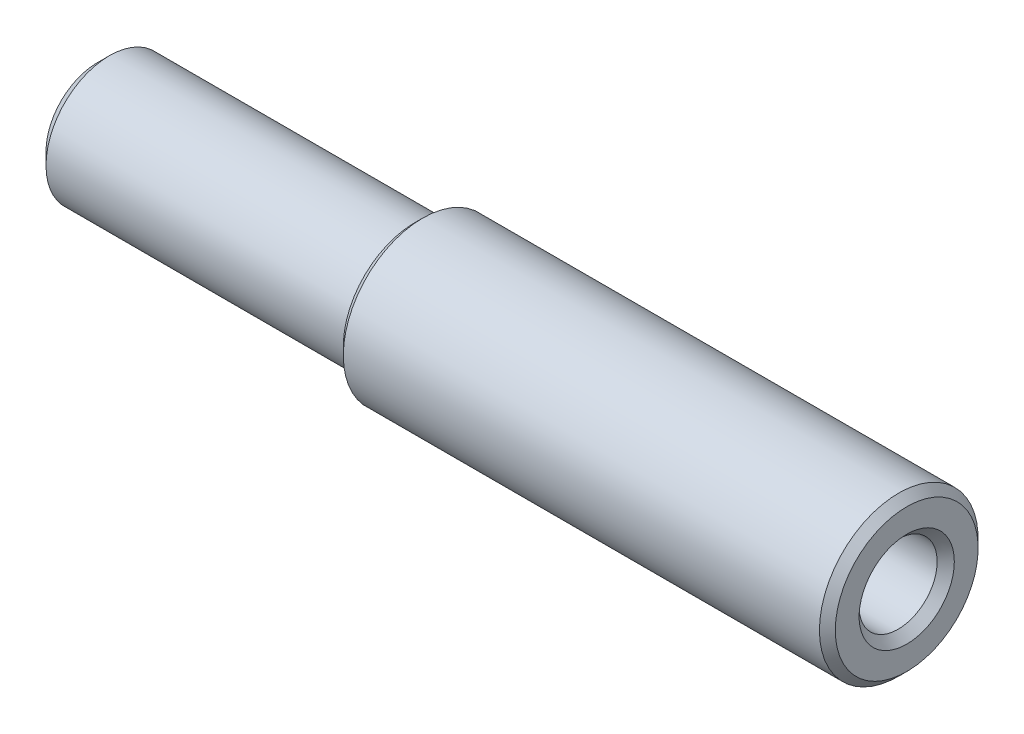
ISO-10303-21;
HEADER;
FILE_DESCRIPTION(('STEP AP214'),'2;1');
FILE_NAME('part.step','',(''),(''),'','','');
FILE_SCHEMA(('AUTOMOTIVE_DESIGN { 1 0 10303 214 1 1 1 1 }'));
ENDSEC;
DATA;
#1=APPLICATION_CONTEXT('core data for automotive mechanical design processes');
#2=APPLICATION_PROTOCOL_DEFINITION('international standard','automotive_design',2000,#1);
#3=PRODUCT_CONTEXT('',#1,'mechanical');
#4=PRODUCT('Part','Part','',(#3));
#5=PRODUCT_RELATED_PRODUCT_CATEGORY('part','',(#4));
#6=PRODUCT_DEFINITION_FORMATION('','',#4);
#7=PRODUCT_DEFINITION_CONTEXT('part definition',#1,'design');
#8=PRODUCT_DEFINITION('design','',#6,#7);
#9=PRODUCT_DEFINITION_SHAPE('','',#8);
#10=(LENGTH_UNIT() NAMED_UNIT(*) SI_UNIT(.MILLI.,.METRE.));
#11=(NAMED_UNIT(*) PLANE_ANGLE_UNIT() SI_UNIT($,.RADIAN.));
#12=(NAMED_UNIT(*) SI_UNIT($,.STERADIAN.) SOLID_ANGLE_UNIT());
#13=UNCERTAINTY_MEASURE_WITH_UNIT(LENGTH_MEASURE(1.E-05),#10,'distance_accuracy_value','');
#14=(GEOMETRIC_REPRESENTATION_CONTEXT(3) GLOBAL_UNCERTAINTY_ASSIGNED_CONTEXT((#13)) GLOBAL_UNIT_ASSIGNED_CONTEXT((#10,
#11,#12)) REPRESENTATION_CONTEXT('',''));
#15=CARTESIAN_POINT('',(0.,0.,0.));
#16=DIRECTION('',(0.,0.,1.));
#17=DIRECTION('',(1.,0.,0.));
#18=AXIS2_PLACEMENT_3D('',#15,#16,#17);
#19=CARTESIAN_POINT('',(-20.,0.,0.));
#20=DIRECTION('',(1.,0.,0.));
#21=DIRECTION('',(0.,0.,-1.));
#22=AXIS2_PLACEMENT_3D('',#19,#20,#21);
#23=PLANE('',#22);
#24=CARTESIAN_POINT('',(-19.9999999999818,0.,0.));
#25=DIRECTION('',(1.,0.,0.));
#26=DIRECTION('',(0.,0.,-1.));
#27=AXIS2_PLACEMENT_3D('',#24,#25,#26);
#28=CIRCLE('',#27,3.23300000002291);
#29=CARTESIAN_POINT('',(-19.9999999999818,0.,-3.23300000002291));
#30=VERTEX_POINT('',#29);
#31=EDGE_CURVE('E19',#30,#30,#28,.T.);
#32=ORIENTED_EDGE('',*,*,#31,.F.);
#33=EDGE_LOOP('',(#32));
#34=FACE_BOUND('',#33,.T.);
#35=ADVANCED_FACE('F16',(#34),#23,.F.);
#36=CARTESIAN_POINT('',(13.4194156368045,0.,0.));
#37=DIRECTION('',(1.,0.,0.));
#38=DIRECTION('',(0.,0.,-1.));
#39=AXIS2_PLACEMENT_3D('',#36,#37,#38);
#40=CONICAL_SURFACE('',#39,2.45849999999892,1.04719755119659);
#41=CARTESIAN_POINT('',(12.0000000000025,0.,0.));
#42=VERTEX_POINT('',#41);
#43=VERTEX_LOOP('',#42);
#44=FACE_BOUND('',#43,.T.);
#45=CARTESIAN_POINT('',(13.4194156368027,0.,0.));
#46=DIRECTION('',(-1.,0.,0.));
#47=DIRECTION('',(0.,0.,1.));
#48=AXIS2_PLACEMENT_3D('',#45,#46,#47);
#49=CIRCLE('',#48,2.4585);
#50=CARTESIAN_POINT('',(13.4194156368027,0.,2.4585));
#51=VERTEX_POINT('',#50);
#52=EDGE_CURVE('E33',#51,#51,#49,.F.);
#53=ORIENTED_EDGE('',*,*,#52,.T.);
#54=EDGE_LOOP('',(#53));
#55=FACE_BOUND('',#54,.T.);
#56=ADVANCED_FACE('F27',(#44,#55),#40,.F.);
#57=CARTESIAN_POINT('',(-19.2330000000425,0.,0.));
#58=DIRECTION('',(1.,0.,0.));
#59=DIRECTION('',(0.,0.,-1.));
#60=AXIS2_PLACEMENT_3D('',#57,#58,#59);
#61=CONICAL_SURFACE('',#60,3.99999999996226,0.785398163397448);
#62=ORIENTED_EDGE('',*,*,#31,.T.);
#63=EDGE_LOOP('',(#62));
#64=FACE_BOUND('',#63,.T.);
#65=CARTESIAN_POINT('',(-19.233,0.,0.));
#66=DIRECTION('',(-1.,0.,0.));
#67=DIRECTION('',(0.,0.,1.));
#68=AXIS2_PLACEMENT_3D('',#65,#66,#67);
#69=CIRCLE('',#68,4.);
#70=CARTESIAN_POINT('',(-19.233,0.,4.));
#71=VERTEX_POINT('',#70);
#72=EDGE_CURVE('E35',#71,#71,#69,.F.);
#73=ORIENTED_EDGE('',*,*,#72,.F.);
#74=EDGE_LOOP('',(#73));
#75=FACE_BOUND('',#74,.T.);
#76=ADVANCED_FACE('F30',(#64,#75),#61,.T.);
#77=CARTESIAN_POINT('',(31.,0.,0.));
#78=DIRECTION('',(-1.,0.,0.));
#79=DIRECTION('',(0.,0.,1.));
#80=AXIS2_PLACEMENT_3D('',#77,#78,#79);
#81=CYLINDRICAL_SURFACE('',#80,2.4585);
#82=ORIENTED_EDGE('',*,*,#52,.F.);
#83=EDGE_LOOP('',(#82));
#84=FACE_BOUND('',#83,.T.);
#85=CARTESIAN_POINT('',(30.4585000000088,0.,0.));
#86=DIRECTION('',(1.,0.,0.));
#87=DIRECTION('',(0.,0.,-1.));
#88=AXIS2_PLACEMENT_3D('',#85,#86,#87);
#89=CIRCLE('',#88,2.45849999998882);
#90=CARTESIAN_POINT('',(30.4585000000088,0.,-2.45849999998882));
#91=VERTEX_POINT('',#90);
#92=EDGE_CURVE('E38',#91,#91,#89,.T.);
#93=ORIENTED_EDGE('',*,*,#92,.T.);
#94=EDGE_LOOP('',(#93));
#95=FACE_BOUND('',#94,.T.);
#96=ADVANCED_FACE('F97',(#84,#95),#81,.F.);
#97=CARTESIAN_POINT('',(31.,0.,0.));
#98=DIRECTION('',(-1.,0.,0.));
#99=DIRECTION('',(0.,0.,1.));
#100=AXIS2_PLACEMENT_3D('',#97,#98,#99);
#101=CYLINDRICAL_SURFACE('',#100,4.);
#102=ORIENTED_EDGE('',*,*,#72,.T.);
#103=EDGE_LOOP('',(#102));
#104=FACE_BOUND('',#103,.T.);
#105=CARTESIAN_POINT('',(-0.300000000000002,0.,0.));
#106=DIRECTION('',(1.,0.,0.));
#107=DIRECTION('',(0.,0.,-1.));
#108=AXIS2_PLACEMENT_3D('',#105,#106,#107);
#109=CIRCLE('',#108,4.);
#110=CARTESIAN_POINT('',(-0.300000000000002,0.,-4.));
#111=VERTEX_POINT('',#110);
#112=EDGE_CURVE('E54',#111,#111,#109,.F.);
#113=ORIENTED_EDGE('',*,*,#112,.T.);
#114=EDGE_LOOP('',(#113));
#115=FACE_BOUND('',#114,.T.);
#116=ADVANCED_FACE('F93',(#104,#115),#101,.T.);
#117=CARTESIAN_POINT('',(31.0000000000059,0.,0.));
#118=DIRECTION('',(1.,0.,0.));
#119=DIRECTION('',(0.,0.,-1.));
#120=AXIS2_PLACEMENT_3D('',#117,#118,#119);
#121=CONICAL_SURFACE('',#120,2.9999999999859,0.785398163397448);
#122=ORIENTED_EDGE('',*,*,#92,.F.);
#123=EDGE_LOOP('',(#122));
#124=FACE_BOUND('',#123,.T.);
#125=CARTESIAN_POINT('',(31.0000000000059,0.,0.));
#126=DIRECTION('',(1.,0.,0.));
#127=DIRECTION('',(0.,0.,-1.));
#128=AXIS2_PLACEMENT_3D('',#125,#126,#127);
#129=CIRCLE('',#128,2.9999999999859);
#130=CARTESIAN_POINT('',(31.0000000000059,0.,-2.9999999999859));
#131=VERTEX_POINT('',#130);
#132=EDGE_CURVE('E52',#131,#131,#129,.T.);
#133=ORIENTED_EDGE('',*,*,#132,.T.);
#134=EDGE_LOOP('',(#133));
#135=FACE_BOUND('',#134,.T.);
#136=ADVANCED_FACE('F88',(#124,#135),#121,.F.);
#137=CARTESIAN_POINT('',(-0.300000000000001,0.,0.));
#138=DIRECTION('',(1.,0.,0.));
#139=DIRECTION('',(0.,0.,-1.));
#140=AXIS2_PLACEMENT_3D('',#137,#138,#139);
#141=TOROIDAL_SURFACE('',#140,4.3,0.300000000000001);
#142=ORIENTED_EDGE('',*,*,#112,.F.);
#143=EDGE_LOOP('',(#142));
#144=FACE_BOUND('',#143,.T.);
#145=CARTESIAN_POINT('',(0.,0.,0.));
#146=DIRECTION('',(-1.,0.,0.));
#147=DIRECTION('',(0.,0.,-1.));
#148=AXIS2_PLACEMENT_3D('',#145,#146,#147);
#149=CIRCLE('',#148,4.3);
#150=CARTESIAN_POINT('',(0.,0.,-4.3));
#151=VERTEX_POINT('',#150);
#152=EDGE_CURVE('E51',#151,#151,#149,.T.);
#153=ORIENTED_EDGE('',*,*,#152,.T.);
#154=EDGE_LOOP('',(#153));
#155=FACE_BOUND('',#154,.T.);
#156=ADVANCED_FACE('F77',(#144,#155),#141,.F.);
#157=CARTESIAN_POINT('',(31.,4.5,0.));
#158=DIRECTION('',(-1.,0.,0.));
#159=DIRECTION('',(0.,0.,1.));
#160=AXIS2_PLACEMENT_3D('',#157,#158,#159);
#161=PLANE('',#160);
#162=CARTESIAN_POINT('',(31.0000000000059,0.,0.));
#163=DIRECTION('',(-1.,0.,0.));
#164=DIRECTION('',(0.,0.,1.));
#165=AXIS2_PLACEMENT_3D('',#162,#163,#164);
#166=CIRCLE('',#165,4.49999999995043);
#167=CARTESIAN_POINT('',(31.0000000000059,0.,4.49999999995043));
#168=VERTEX_POINT('',#167);
#169=EDGE_CURVE('E49',#168,#168,#166,.T.);
#170=ORIENTED_EDGE('',*,*,#169,.F.);
#171=EDGE_LOOP('',(#170));
#172=FACE_BOUND('',#171,.T.);
#173=ORIENTED_EDGE('',*,*,#132,.F.);
#174=EDGE_LOOP('',(#173));
#175=FACE_BOUND('',#174,.T.);
#176=ADVANCED_FACE('F87',(#172,#175),#161,.F.);
#177=CARTESIAN_POINT('',(0.,4.3,0.));
#178=DIRECTION('',(1.,0.,0.));
#179=DIRECTION('',(0.,0.,-1.));
#180=AXIS2_PLACEMENT_3D('',#177,#178,#179);
#181=PLANE('',#180);
#182=ORIENTED_EDGE('',*,*,#152,.F.);
#183=EDGE_LOOP('',(#182));
#184=FACE_BOUND('',#183,.T.);
#185=CARTESIAN_POINT('',(0.,0.,0.));
#186=DIRECTION('',(1.,0.,0.));
#187=DIRECTION('',(0.,0.,-1.));
#188=AXIS2_PLACEMENT_3D('',#185,#186,#187);
#189=CIRCLE('',#188,4.49999999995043);
#190=CARTESIAN_POINT('',(0.,0.,-4.49999999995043));
#191=VERTEX_POINT('',#190);
#192=EDGE_CURVE('E46',#191,#191,#189,.T.);
#193=ORIENTED_EDGE('',*,*,#192,.F.);
#194=EDGE_LOOP('',(#193));
#195=FACE_BOUND('',#194,.T.);
#196=ADVANCED_FACE('F121',(#184,#195),#181,.F.);
#197=CARTESIAN_POINT('',(30.5000000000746,0.,0.));
#198=DIRECTION('',(-1.,0.,0.));
#199=DIRECTION('',(0.,0.,1.));
#200=AXIS2_PLACEMENT_3D('',#197,#198,#199);
#201=CONICAL_SURFACE('',#200,4.99999999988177,0.785398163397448);
#202=CARTESIAN_POINT('',(30.5,0.,0.));
#203=DIRECTION('',(-1.,0.,0.));
#204=DIRECTION('',(0.,0.,1.));
#205=AXIS2_PLACEMENT_3D('',#202,#203,#204);
#206=CIRCLE('',#205,5.);
#207=CARTESIAN_POINT('',(30.5,0.,5.));
#208=VERTEX_POINT('',#207);
#209=EDGE_CURVE('E23',#208,#208,#206,.T.);
#210=ORIENTED_EDGE('',*,*,#209,.F.);
#211=EDGE_LOOP('',(#210));
#212=FACE_BOUND('',#211,.T.);
#213=ORIENTED_EDGE('',*,*,#169,.T.);
#214=EDGE_LOOP('',(#213));
#215=FACE_BOUND('',#214,.T.);
#216=ADVANCED_FACE('F115',(#212,#215),#201,.T.);
#217=CARTESIAN_POINT('',(0.499999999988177,0.,0.));
#218=DIRECTION('',(1.,0.,0.));
#219=DIRECTION('',(0.,0.,-1.));
#220=AXIS2_PLACEMENT_3D('',#217,#218,#219);
#221=CONICAL_SURFACE('',#220,4.99999999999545,0.785398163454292);
#222=ORIENTED_EDGE('',*,*,#192,.T.);
#223=EDGE_LOOP('',(#222));
#224=FACE_BOUND('',#223,.T.);
#225=CARTESIAN_POINT('',(0.5,0.,0.));
#226=DIRECTION('',(-1.,0.,0.));
#227=DIRECTION('',(0.,0.,1.));
#228=AXIS2_PLACEMENT_3D('',#225,#226,#227);
#229=CIRCLE('',#228,5.);
#230=CARTESIAN_POINT('',(0.5,0.,5.));
#231=VERTEX_POINT('',#230);
#232=EDGE_CURVE('E11',#231,#231,#229,.F.);
#233=ORIENTED_EDGE('',*,*,#232,.F.);
#234=EDGE_LOOP('',(#233));
#235=FACE_BOUND('',#234,.T.);
#236=ADVANCED_FACE('F109',(#224,#235),#221,.T.);
#237=CARTESIAN_POINT('',(31.,0.,0.));
#238=DIRECTION('',(-1.,0.,0.));
#239=DIRECTION('',(0.,0.,1.));
#240=AXIS2_PLACEMENT_3D('',#237,#238,#239);
#241=CYLINDRICAL_SURFACE('',#240,5.);
#242=ORIENTED_EDGE('',*,*,#232,.T.);
#243=EDGE_LOOP('',(#242));
#244=FACE_BOUND('',#243,.T.);
#245=ORIENTED_EDGE('',*,*,#209,.T.);
#246=EDGE_LOOP('',(#245));
#247=FACE_BOUND('',#246,.T.);
#248=ADVANCED_FACE('F107',(#244,#247),#241,.T.);
#249=CLOSED_SHELL('',(#35,#56,#76,#96,#116,#136,#156,#176,#196,#216,#236,#248));
#250=MANIFOLD_SOLID_BREP('B1',#249);
#251=ADVANCED_BREP_SHAPE_REPRESENTATION('',(#18,#250),#14);
#252=SHAPE_DEFINITION_REPRESENTATION(#9,#251);
ENDSEC;
END-ISO-10303-21;
